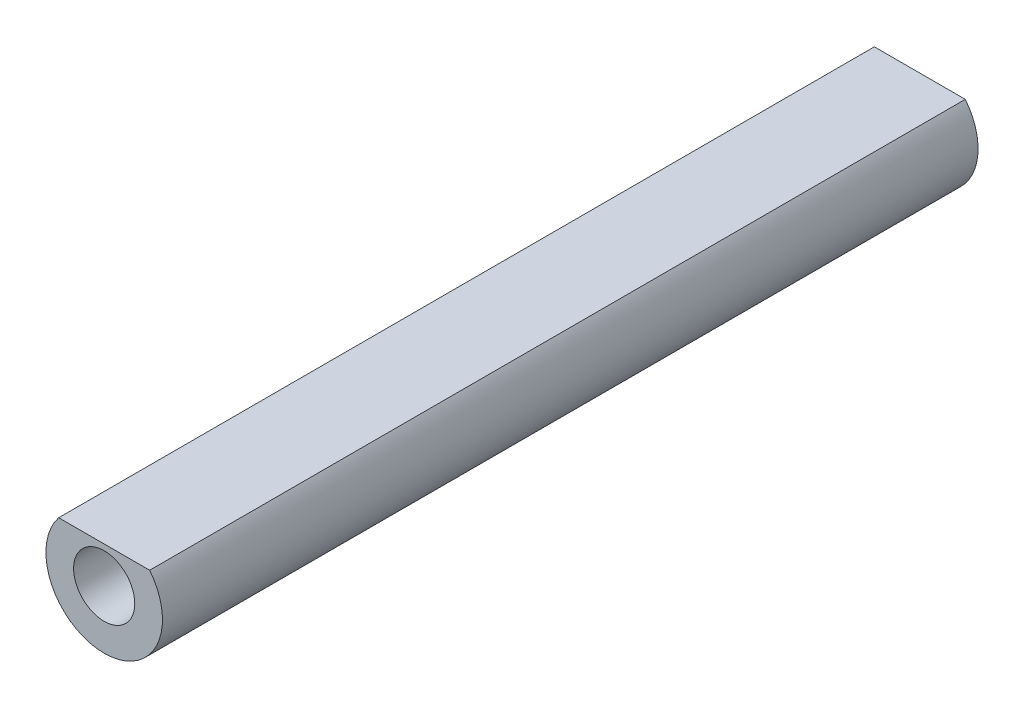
ISO-10303-21;
HEADER;
FILE_DESCRIPTION(('STEP AP214'),'2;1');
FILE_NAME('part.step','',(''),(''),'','','');
FILE_SCHEMA(('AUTOMOTIVE_DESIGN { 1 0 10303 214 1 1 1 1 }'));
ENDSEC;
DATA;
#1=APPLICATION_CONTEXT('core data for automotive mechanical design processes');
#2=APPLICATION_PROTOCOL_DEFINITION('international standard','automotive_design',2000,#1);
#3=PRODUCT_CONTEXT('',#1,'mechanical');
#4=PRODUCT('Part','Part','',(#3));
#5=PRODUCT_RELATED_PRODUCT_CATEGORY('part','',(#4));
#6=PRODUCT_DEFINITION_FORMATION('','',#4);
#7=PRODUCT_DEFINITION_CONTEXT('part definition',#1,'design');
#8=PRODUCT_DEFINITION('design','',#6,#7);
#9=PRODUCT_DEFINITION_SHAPE('','',#8);
#10=(LENGTH_UNIT() NAMED_UNIT(*) SI_UNIT(.MILLI.,.METRE.));
#11=(NAMED_UNIT(*) PLANE_ANGLE_UNIT() SI_UNIT($,.RADIAN.));
#12=(NAMED_UNIT(*) SI_UNIT($,.STERADIAN.) SOLID_ANGLE_UNIT());
#13=UNCERTAINTY_MEASURE_WITH_UNIT(LENGTH_MEASURE(1.E-05),#10,'distance_accuracy_value','');
#14=(GEOMETRIC_REPRESENTATION_CONTEXT(3) GLOBAL_UNCERTAINTY_ASSIGNED_CONTEXT((#13)) GLOBAL_UNIT_ASSIGNED_CONTEXT((#10,
#11,#12)) REPRESENTATION_CONTEXT('',''));
#15=CARTESIAN_POINT('',(0.,0.,0.));
#16=DIRECTION('',(0.,0.,1.));
#17=DIRECTION('',(1.,0.,0.));
#18=AXIS2_PLACEMENT_3D('',#15,#16,#17);
#19=CARTESIAN_POINT('',(0.,0.,28.));
#20=DIRECTION('',(0.,0.,-1.));
#21=DIRECTION('',(-1.,0.,0.));
#22=AXIS2_PLACEMENT_3D('',#19,#20,#21);
#23=CYLINDRICAL_SURFACE('',#22,4.);
#24=DIRECTION('',(0.,0.,-1.));
#25=VECTOR('',#24,1.);
#26=CARTESIAN_POINT('',(3.1224989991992,2.5,28.));
#27=LINE('',#26,#25);
#28=CARTESIAN_POINT('',(3.1224989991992,2.5,28.));
#29=VERTEX_POINT('',#28);
#30=CARTESIAN_POINT('',(3.1224989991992,2.5,-28.));
#31=VERTEX_POINT('',#30);
#32=EDGE_CURVE('E68',#29,#31,#27,.T.);
#33=ORIENTED_EDGE('',*,*,#32,.F.);
#34=CARTESIAN_POINT('',(0.,0.,28.));
#35=DIRECTION('',(0.,0.,1.));
#36=DIRECTION('',(1.,0.,0.));
#37=AXIS2_PLACEMENT_3D('',#34,#35,#36);
#38=CIRCLE('',#37,4.);
#39=CARTESIAN_POINT('',(-3.1224989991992,2.5,28.));
#40=VERTEX_POINT('',#39);
#41=EDGE_CURVE('E11',#40,#29,#38,.T.);
#42=ORIENTED_EDGE('',*,*,#41,.F.);
#43=DIRECTION('',(0.,0.,-1.));
#44=VECTOR('',#43,1.);
#45=CARTESIAN_POINT('',(-3.1224989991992,2.5,28.));
#46=LINE('',#45,#44);
#47=CARTESIAN_POINT('',(-3.1224989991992,2.5,-28.));
#48=VERTEX_POINT('',#47);
#49=EDGE_CURVE('E64',#48,#40,#46,.F.);
#50=ORIENTED_EDGE('',*,*,#49,.F.);
#51=CARTESIAN_POINT('',(0.,0.,-28.));
#52=DIRECTION('',(0.,0.,1.));
#53=DIRECTION('',(1.,0.,0.));
#54=AXIS2_PLACEMENT_3D('',#51,#52,#53);
#55=CIRCLE('',#54,4.);
#56=EDGE_CURVE('E67',#48,#31,#55,.T.);
#57=ORIENTED_EDGE('',*,*,#56,.T.);
#58=EDGE_LOOP('',(#33,#42,#50,#57));
#59=FACE_BOUND('',#58,.T.);
#60=ADVANCED_FACE('F33',(#59),#23,.T.);
#61=CARTESIAN_POINT('',(0.,0.,28.));
#62=DIRECTION('',(0.,0.,1.));
#63=DIRECTION('',(1.,0.,0.));
#64=AXIS2_PLACEMENT_3D('',#61,#62,#63);
#65=PLANE('',#64);
#66=CARTESIAN_POINT('',(0.,0.,28.));
#67=DIRECTION('',(0.,0.,1.));
#68=DIRECTION('',(1.,0.,0.));
#69=AXIS2_PLACEMENT_3D('',#66,#67,#68);
#70=CIRCLE('',#69,2.1);
#71=CARTESIAN_POINT('',(2.1,0.,28.));
#72=VERTEX_POINT('',#71);
#73=EDGE_CURVE('E40',#72,#72,#70,.T.);
#74=ORIENTED_EDGE('',*,*,#73,.F.);
#75=EDGE_LOOP('',(#74));
#76=FACE_BOUND('',#75,.T.);
#77=ORIENTED_EDGE('',*,*,#41,.T.);
#78=DIRECTION('',(1.,0.,0.));
#79=VECTOR('',#78,1.);
#80=CARTESIAN_POINT('',(-5.16613831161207,2.5,28.));
#81=LINE('',#80,#79);
#82=EDGE_CURVE('E50',#40,#29,#81,.T.);
#83=ORIENTED_EDGE('',*,*,#82,.F.);
#84=EDGE_LOOP('',(#77,#83));
#85=FACE_BOUND('',#84,.T.);
#86=ADVANCED_FACE('F92',(#76,#85),#65,.T.);
#87=CARTESIAN_POINT('',(0.,0.,28.));
#88=DIRECTION('',(0.,0.,1.));
#89=DIRECTION('',(1.,0.,0.));
#90=AXIS2_PLACEMENT_3D('',#87,#88,#89);
#91=CYLINDRICAL_SURFACE('',#90,2.1);
#92=CARTESIAN_POINT('',(0.,0.,13.6));
#93=DIRECTION('',(0.,0.,1.));
#94=DIRECTION('',(1.,0.,0.));
#95=AXIS2_PLACEMENT_3D('',#92,#93,#94);
#96=CIRCLE('',#95,2.1);
#97=CARTESIAN_POINT('',(2.1,0.,13.6));
#98=VERTEX_POINT('',#97);
#99=EDGE_CURVE('E85',#98,#98,#96,.T.);
#100=ORIENTED_EDGE('',*,*,#99,.F.);
#101=EDGE_LOOP('',(#100));
#102=FACE_BOUND('',#101,.T.);
#103=ORIENTED_EDGE('',*,*,#73,.T.);
#104=EDGE_LOOP('',(#103));
#105=FACE_BOUND('',#104,.T.);
#106=ADVANCED_FACE('F90',(#102,#105),#91,.F.);
#107=CARTESIAN_POINT('',(0.,0.,13.6));
#108=DIRECTION('',(0.,0.,1.));
#109=DIRECTION('',(1.,0.,0.));
#110=AXIS2_PLACEMENT_3D('',#107,#108,#109);
#111=CONICAL_SURFACE('',#110,2.1,1.02974425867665);
#112=CARTESIAN_POINT('',(0.,0.,12.3381927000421));
#113=VERTEX_POINT('',#112);
#114=VERTEX_LOOP('',#113);
#115=FACE_BOUND('',#114,.T.);
#116=ORIENTED_EDGE('',*,*,#99,.T.);
#117=EDGE_LOOP('',(#116));
#118=FACE_BOUND('',#117,.T.);
#119=ADVANCED_FACE('F99',(#115,#118),#111,.F.);
#120=CARTESIAN_POINT('',(-5.16613831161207,2.5,28.));
#121=DIRECTION('',(0.,1.,0.));
#122=DIRECTION('',(0.,0.,1.));
#123=AXIS2_PLACEMENT_3D('',#120,#121,#122);
#124=PLANE('',#123);
#125=ORIENTED_EDGE('',*,*,#32,.T.);
#126=DIRECTION('',(1.,0.,0.));
#127=VECTOR('',#126,1.);
#128=CARTESIAN_POINT('',(-5.16613831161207,2.5,-28.));
#129=LINE('',#128,#127);
#130=EDGE_CURVE('E71',#48,#31,#129,.T.);
#131=ORIENTED_EDGE('',*,*,#130,.F.);
#132=ORIENTED_EDGE('',*,*,#49,.T.);
#133=ORIENTED_EDGE('',*,*,#82,.T.);
#134=EDGE_LOOP('',(#125,#131,#132,#133));
#135=FACE_BOUND('',#134,.T.);
#136=ADVANCED_FACE('F72',(#135),#124,.T.);
#137=CARTESIAN_POINT('',(0.,0.,-28.));
#138=DIRECTION('',(0.,0.,-1.));
#139=DIRECTION('',(1.,0.,0.));
#140=AXIS2_PLACEMENT_3D('',#137,#138,#139);
#141=PLANE('',#140);
#142=CARTESIAN_POINT('',(0.,0.,-28.));
#143=DIRECTION('',(0.,0.,1.));
#144=DIRECTION('',(1.,0.,0.));
#145=AXIS2_PLACEMENT_3D('',#142,#143,#144);
#146=CIRCLE('',#145,2.1);
#147=CARTESIAN_POINT('',(2.1,0.,-28.));
#148=VERTEX_POINT('',#147);
#149=EDGE_CURVE('E77',#148,#148,#146,.T.);
#150=ORIENTED_EDGE('',*,*,#149,.T.);
#151=EDGE_LOOP('',(#150));
#152=FACE_BOUND('',#151,.T.);
#153=ORIENTED_EDGE('',*,*,#56,.F.);
#154=ORIENTED_EDGE('',*,*,#130,.T.);
#155=EDGE_LOOP('',(#153,#154));
#156=FACE_BOUND('',#155,.T.);
#157=ADVANCED_FACE('F76',(#152,#156),#141,.T.);
#158=CARTESIAN_POINT('',(0.,0.,-28.));
#159=DIRECTION('',(0.,0.,-1.));
#160=DIRECTION('',(1.,0.,0.));
#161=AXIS2_PLACEMENT_3D('',#158,#159,#160);
#162=CYLINDRICAL_SURFACE('',#161,2.1);
#163=CARTESIAN_POINT('',(0.,0.,-13.6));
#164=DIRECTION('',(0.,0.,1.));
#165=DIRECTION('',(1.,0.,0.));
#166=AXIS2_PLACEMENT_3D('',#163,#164,#165);
#167=CIRCLE('',#166,2.1);
#168=CARTESIAN_POINT('',(2.1,0.,-13.6));
#169=VERTEX_POINT('',#168);
#170=EDGE_CURVE('E74',#169,#169,#167,.T.);
#171=ORIENTED_EDGE('',*,*,#170,.T.);
#172=EDGE_LOOP('',(#171));
#173=FACE_BOUND('',#172,.T.);
#174=ORIENTED_EDGE('',*,*,#149,.F.);
#175=EDGE_LOOP('',(#174));
#176=FACE_BOUND('',#175,.T.);
#177=ADVANCED_FACE('F109',(#173,#176),#162,.F.);
#178=CARTESIAN_POINT('',(0.,0.,-13.6));
#179=DIRECTION('',(0.,0.,-1.));
#180=DIRECTION('',(1.,0.,0.));
#181=AXIS2_PLACEMENT_3D('',#178,#179,#180);
#182=CONICAL_SURFACE('',#181,2.1,1.02974425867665);
#183=CARTESIAN_POINT('',(0.,0.,-12.3381927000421));
#184=VERTEX_POINT('',#183);
#185=VERTEX_LOOP('',#184);
#186=FACE_BOUND('',#185,.T.);
#187=ORIENTED_EDGE('',*,*,#170,.F.);
#188=EDGE_LOOP('',(#187));
#189=FACE_BOUND('',#188,.T.);
#190=ADVANCED_FACE('F113',(#186,#189),#182,.F.);
#191=CLOSED_SHELL('',(#60,#86,#106,#119,#136,#157,#177,#190));
#192=MANIFOLD_SOLID_BREP('B2',#191);
#193=ADVANCED_BREP_SHAPE_REPRESENTATION('',(#18,#192),#14);
#194=SHAPE_DEFINITION_REPRESENTATION(#9,#193);
ENDSEC;
END-ISO-10303-21;
